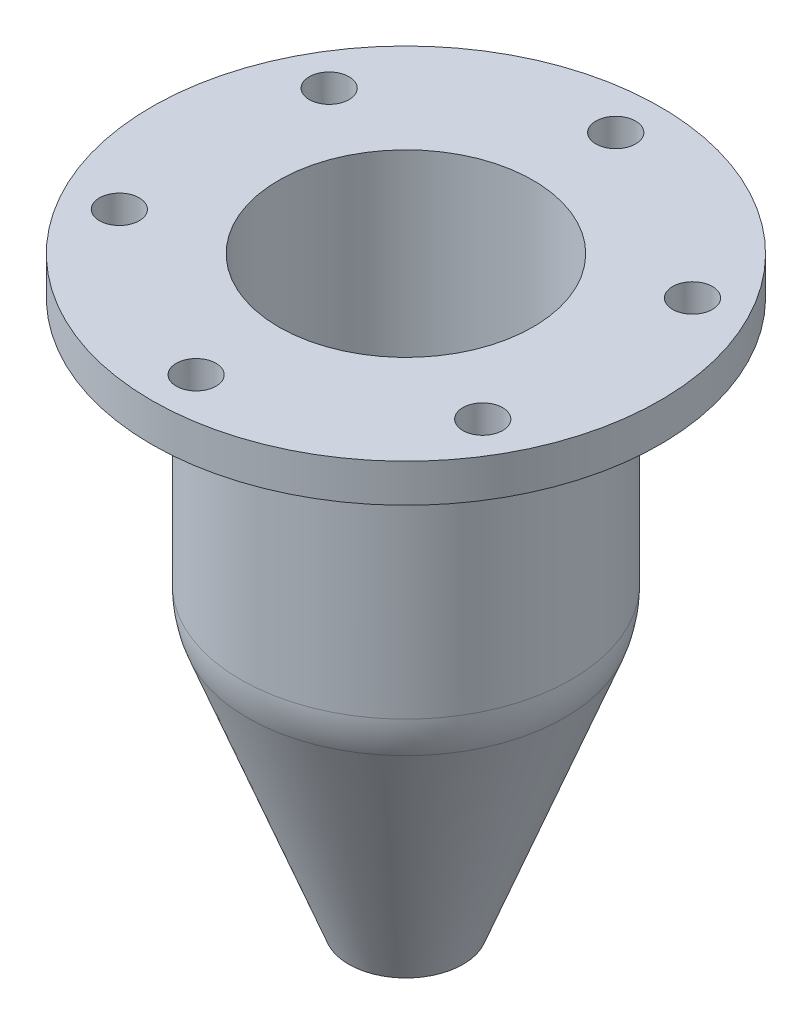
from build123d import *

# Parameters (mm, degrees)
SKETCH2_R          = 4.9657
CUT_EXTRUDE1_DEPTH = 200.191716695
CIRPATTERN1_COUNT  = 6
FILLET1_R          = 25.4
SKETCH6_W          = 113.490059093
SKETCH6_H          = 46.395307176
EXTRUDE1_DEPTH     = 38.1


with BuildPart() as part:
    # Sketch1 → Base-Revolve (revolve)
    with BuildSketch(Plane.XY, mode=Mode.PRIVATE) as base_revolve_sk:
        Polygon((-11.440202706, -10.487433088), (-13.488543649, 1.129285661), (-14.2875, 1.129285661), (-41.275, 71.487285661), (-41.275, 138.162285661), (-63.5, 138.162285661), (-63.5, 147.687285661), (-31.75, 147.687285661), (-31.75, 71.487285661), (-24.269293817, 71.487285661), (-5.2705, -4.712714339), (-5.2705, -30.112714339), (-5.750477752, -30.112714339), (-7.963676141, -28.834923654), (-6.177411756, -27.80362343), (-8.401336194, -26.567937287), (-6.615712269, -25.536512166), (-8.839636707, -24.300826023), (-7.055696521, -23.231383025), (-9.165943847, -22.013031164), (-7.397077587, -20.991775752), (-9.566913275, -19.739020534), (-7.798047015, -18.717765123), (-9.967882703, -17.465009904), (-8.199016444, -16.443754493), (-10.368852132, -15.190999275), (-8.599985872, -14.169743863), (-10.76982156, -12.916988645), (-9.000955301, -11.895733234), align=None)
    revolve(base_revolve_sk.sketch.rotate(Axis((0, 210.342148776, 0), (0, -1, 0)), 270), axis=Axis((0, 210.342148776, 0), (0, -1, 0)))

    # Sketch2 → Cut-Extrude1 (cut, through all)
    with BuildSketch(Plane(origin=(0, 147.687285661, 0), x_dir=(-1, 0, 0), z_dir=(0, 1, 0))):
        with Locations(Location((0, 52.3875, 0), (0, 0, 90))):
            Circle(SKETCH2_R)
    cut_extrude1 = extrude(amount=-CUT_EXTRUDE1_DEPTH, mode=Mode.SUBTRACT)

    # CirPattern1: Cut-Extrude1 ×6 about axis
    cirpattern1_axis = Axis((0, 0, 0), (0, 1, 0))
    for i in range(1, CIRPATTERN1_COUNT):
        add(cut_extrude1.rotate(cirpattern1_axis, i * 360 / CIRPATTERN1_COUNT), mode=Mode.SUBTRACT)

    # Fillet1
    fillet1_edges = [part.edges().sort_by_distance(p)[0] for p in [
        (0, 71.487285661, -41.275),
    ]]
    fillet(fillet1_edges, radius=FILLET1_R)

    # Sketch6 → Extrude1 (cut, symmetric)
    with BuildSketch(Plane.XY):
        with Locations((3.640247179, -22.068367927)):
            Rectangle(SKETCH6_W, SKETCH6_H)
    extrude(amount=EXTRUDE1_DEPTH, both=True, mode=Mode.SUBTRACT)


solid = part.part
